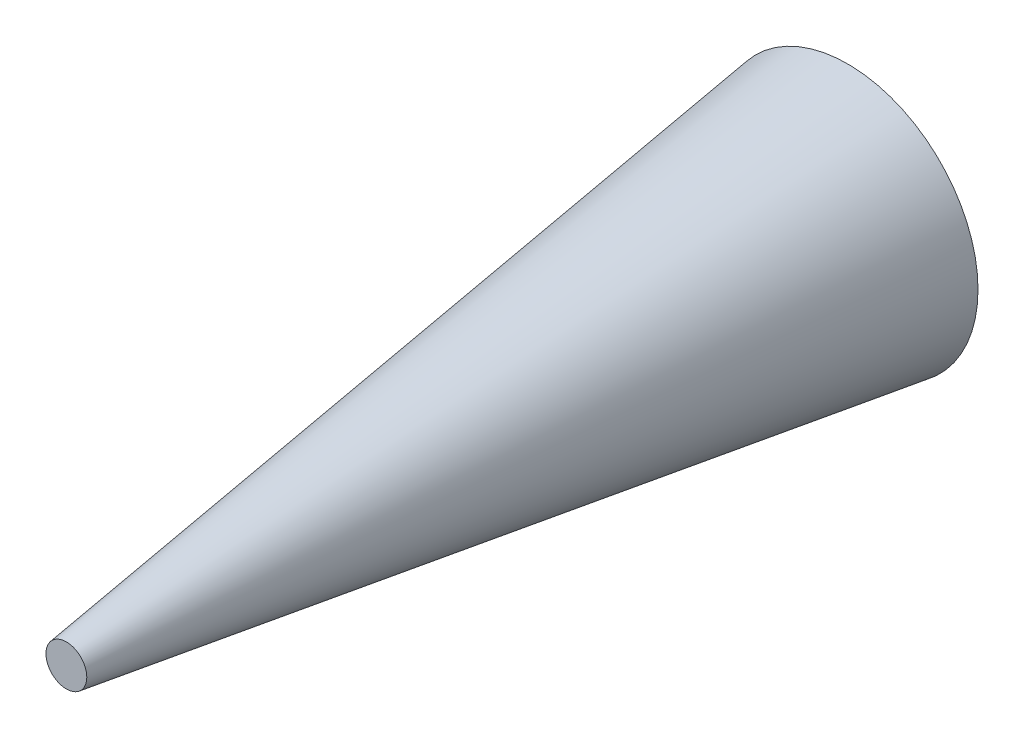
from build123d import *

# Parameters (mm, degrees)
SKETCH1_R           = 10
BOSS_EXTRUDE1_DEPTH = 60
BOSS_EXTRUDE1_TAPER = 8


with BuildPart() as part:
    # Sketch1 → Boss-Extrude1 (new body)
    with BuildSketch(Plane.XY):
        Circle(SKETCH1_R)
    extrude(amount=BOSS_EXTRUDE1_DEPTH, taper=BOSS_EXTRUDE1_TAPER)


solid = part.part
